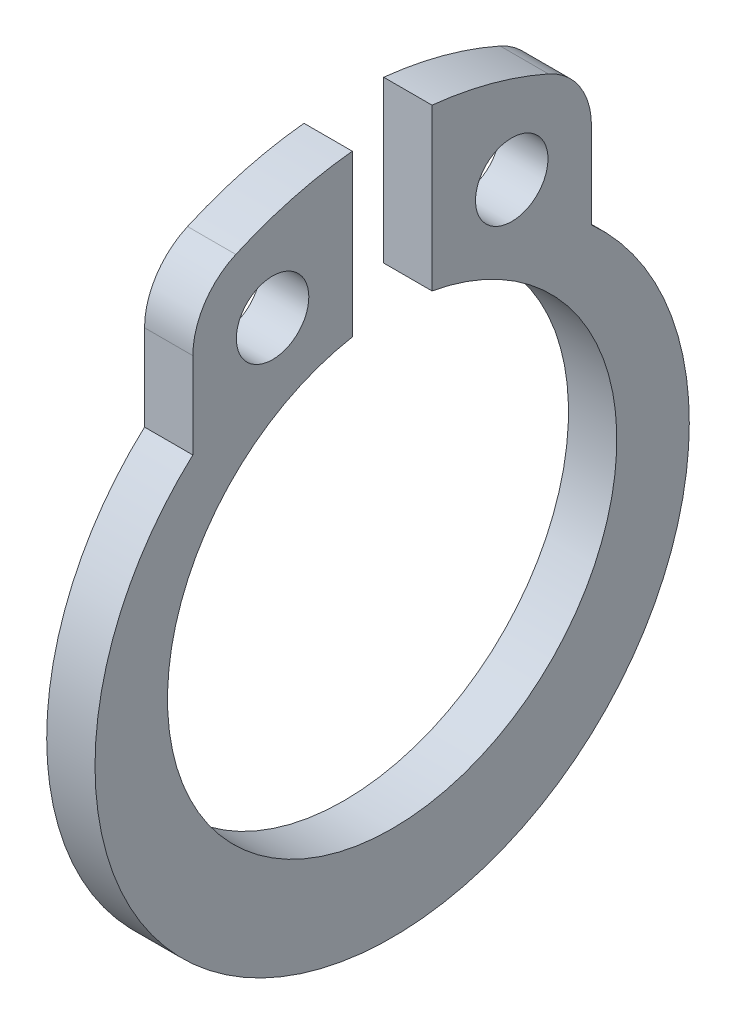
ISO-10303-21;
HEADER;
FILE_DESCRIPTION(('STEP AP214'),'2;1');
FILE_NAME('part.step','',(''),(''),'','','');
FILE_SCHEMA(('AUTOMOTIVE_DESIGN { 1 0 10303 214 1 1 1 1 }'));
ENDSEC;
DATA;
#1=APPLICATION_CONTEXT('core data for automotive mechanical design processes');
#2=APPLICATION_PROTOCOL_DEFINITION('international standard','automotive_design',2000,#1);
#3=PRODUCT_CONTEXT('',#1,'mechanical');
#4=PRODUCT('Part','Part','',(#3));
#5=PRODUCT_RELATED_PRODUCT_CATEGORY('part','',(#4));
#6=PRODUCT_DEFINITION_FORMATION('','',#4);
#7=PRODUCT_DEFINITION_CONTEXT('part definition',#1,'design');
#8=PRODUCT_DEFINITION('design','',#6,#7);
#9=PRODUCT_DEFINITION_SHAPE('','',#8);
#10=(LENGTH_UNIT() NAMED_UNIT(*) SI_UNIT(.MILLI.,.METRE.));
#11=(NAMED_UNIT(*) PLANE_ANGLE_UNIT() SI_UNIT($,.RADIAN.));
#12=(NAMED_UNIT(*) SI_UNIT($,.STERADIAN.) SOLID_ANGLE_UNIT());
#13=UNCERTAINTY_MEASURE_WITH_UNIT(LENGTH_MEASURE(1.E-05),#10,'distance_accuracy_value','');
#14=(GEOMETRIC_REPRESENTATION_CONTEXT(3) GLOBAL_UNCERTAINTY_ASSIGNED_CONTEXT((#13)) GLOBAL_UNIT_ASSIGNED_CONTEXT((#10,
#11,#12)) REPRESENTATION_CONTEXT('',''));
#15=CARTESIAN_POINT('',(0.,0.,0.));
#16=DIRECTION('',(0.,0.,1.));
#17=DIRECTION('',(1.,0.,0.));
#18=AXIS2_PLACEMENT_3D('',#15,#16,#17);
#19=CARTESIAN_POINT('',(1.,5.89167845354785,2.62500000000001));
#20=DIRECTION('',(-1.,0.,0.));
#21=DIRECTION('',(0.,0.,1.));
#22=AXIS2_PLACEMENT_3D('',#19,#20,#21);
#23=CYLINDRICAL_SURFACE('',#22,1.5);
#24=CARTESIAN_POINT('',(0.,5.89167845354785,2.62500000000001));
#25=DIRECTION('',(-1.,0.,0.));
#26=DIRECTION('',(0.,0.,1.));
#27=AXIS2_PLACEMENT_3D('',#24,#25,#26);
#28=CIRCLE('',#27,1.5);
#29=CARTESIAN_POINT('',(0.,5.89167845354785,4.12500000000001));
#30=VERTEX_POINT('',#29);
#31=CARTESIAN_POINT('',(0.,7.2618362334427,3.23546511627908));
#32=VERTEX_POINT('',#31);
#33=EDGE_CURVE('E144',#30,#32,#28,.T.);
#34=ORIENTED_EDGE('',*,*,#33,.F.);
#35=DIRECTION('',(-1.,0.,0.));
#36=VECTOR('',#35,1.);
#37=CARTESIAN_POINT('',(1.,5.89167845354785,4.12500000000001));
#38=LINE('',#37,#36);
#39=CARTESIAN_POINT('',(1.,5.89167845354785,4.12500000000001));
#40=VERTEX_POINT('',#39);
#41=EDGE_CURVE('E11',#40,#30,#38,.T.);
#42=ORIENTED_EDGE('',*,*,#41,.F.);
#43=CARTESIAN_POINT('',(1.,5.89167845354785,2.62500000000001));
#44=DIRECTION('',(-1.,0.,0.));
#45=DIRECTION('',(0.,0.,1.));
#46=AXIS2_PLACEMENT_3D('',#43,#44,#45);
#47=CIRCLE('',#46,1.5);
#48=CARTESIAN_POINT('',(1.,7.2618362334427,3.23546511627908));
#49=VERTEX_POINT('',#48);
#50=EDGE_CURVE('E171',#40,#49,#47,.T.);
#51=ORIENTED_EDGE('',*,*,#50,.T.);
#52=DIRECTION('',(-1.,0.,0.));
#53=VECTOR('',#52,1.);
#54=CARTESIAN_POINT('',(1.,7.2618362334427,3.23546511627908));
#55=LINE('',#54,#53);
#56=EDGE_CURVE('E38',#49,#32,#55,.T.);
#57=ORIENTED_EDGE('',*,*,#56,.T.);
#58=EDGE_LOOP('',(#34,#42,#51,#57));
#59=FACE_BOUND('',#58,.T.);
#60=ADVANCED_FACE('F35',(#59),#23,.T.);
#61=CARTESIAN_POINT('',(1.,4.11145535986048,4.12500000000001));
#62=DIRECTION('',(0.,0.,1.));
#63=DIRECTION('',(0.,-1.,0.));
#64=AXIS2_PLACEMENT_3D('',#61,#62,#63);
#65=PLANE('',#64);
#66=DIRECTION('',(0.,1.,0.));
#67=VECTOR('',#66,1.);
#68=CARTESIAN_POINT('',(0.,4.11145535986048,4.12500000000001));
#69=LINE('',#68,#67);
#70=CARTESIAN_POINT('',(0.,4.11145535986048,4.12500000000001));
#71=VERTEX_POINT('',#70);
#72=EDGE_CURVE('E169',#71,#30,#69,.T.);
#73=ORIENTED_EDGE('',*,*,#72,.F.);
#74=DIRECTION('',(-1.,0.,0.));
#75=VECTOR('',#74,1.);
#76=CARTESIAN_POINT('',(1.,4.11145535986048,4.12500000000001));
#77=LINE('',#76,#75);
#78=CARTESIAN_POINT('',(1.,4.11145535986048,4.12500000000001));
#79=VERTEX_POINT('',#78);
#80=EDGE_CURVE('E44',#79,#71,#77,.T.);
#81=ORIENTED_EDGE('',*,*,#80,.F.);
#82=DIRECTION('',(0.,1.,0.));
#83=VECTOR('',#82,1.);
#84=CARTESIAN_POINT('',(1.,4.11145535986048,4.12500000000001));
#85=LINE('',#84,#83);
#86=EDGE_CURVE('E134',#79,#40,#85,.T.);
#87=ORIENTED_EDGE('',*,*,#86,.T.);
#88=ORIENTED_EDGE('',*,*,#41,.T.);
#89=EDGE_LOOP('',(#73,#81,#87,#88));
#90=FACE_BOUND('',#89,.T.);
#91=ADVANCED_FACE('F187',(#90),#65,.T.);
#92=CARTESIAN_POINT('',(1.,-0.450000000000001,0.));
#93=DIRECTION('',(-1.,0.,0.));
#94=DIRECTION('',(0.,0.,1.));
#95=AXIS2_PLACEMENT_3D('',#92,#93,#94);
#96=CYLINDRICAL_SURFACE('',#95,6.15);
#97=CARTESIAN_POINT('',(0.,-0.450000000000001,0.));
#98=DIRECTION('',(-1.,0.,0.));
#99=DIRECTION('',(0.,0.,1.));
#100=AXIS2_PLACEMENT_3D('',#97,#98,#99);
#101=CIRCLE('',#100,6.15);
#102=CARTESIAN_POINT('',(0.,4.11145535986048,-4.12500000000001));
#103=VERTEX_POINT('',#102);
#104=EDGE_CURVE('E121',#103,#71,#101,.T.);
#105=ORIENTED_EDGE('',*,*,#104,.F.);
#106=DIRECTION('',(-1.,0.,0.));
#107=VECTOR('',#106,1.);
#108=CARTESIAN_POINT('',(1.,4.11145535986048,-4.12500000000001));
#109=LINE('',#108,#107);
#110=CARTESIAN_POINT('',(1.,4.11145535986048,-4.12500000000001));
#111=VERTEX_POINT('',#110);
#112=EDGE_CURVE('E116',#111,#103,#109,.T.);
#113=ORIENTED_EDGE('',*,*,#112,.F.);
#114=CARTESIAN_POINT('',(1.,-0.450000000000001,0.));
#115=DIRECTION('',(-1.,0.,0.));
#116=DIRECTION('',(0.,0.,1.));
#117=AXIS2_PLACEMENT_3D('',#114,#115,#116);
#118=CIRCLE('',#117,6.15);
#119=EDGE_CURVE('E119',#111,#79,#118,.T.);
#120=ORIENTED_EDGE('',*,*,#119,.T.);
#121=ORIENTED_EDGE('',*,*,#80,.T.);
#122=EDGE_LOOP('',(#105,#113,#120,#121));
#123=FACE_BOUND('',#122,.T.);
#124=ADVANCED_FACE('F118',(#123),#96,.T.);
#125=CARTESIAN_POINT('',(1.,5.89167845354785,-4.12500000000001));
#126=DIRECTION('',(0.,0.,-1.));
#127=DIRECTION('',(0.,1.,0.));
#128=AXIS2_PLACEMENT_3D('',#125,#126,#127);
#129=PLANE('',#128);
#130=DIRECTION('',(0.,-1.,0.));
#131=VECTOR('',#130,1.);
#132=CARTESIAN_POINT('',(0.,5.89167845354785,-4.12500000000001));
#133=LINE('',#132,#131);
#134=CARTESIAN_POINT('',(0.,5.89167845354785,-4.12500000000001));
#135=VERTEX_POINT('',#134);
#136=EDGE_CURVE('E166',#135,#103,#133,.T.);
#137=ORIENTED_EDGE('',*,*,#136,.F.);
#138=DIRECTION('',(-1.,0.,0.));
#139=VECTOR('',#138,1.);
#140=CARTESIAN_POINT('',(1.,5.89167845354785,-4.12500000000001));
#141=LINE('',#140,#139);
#142=CARTESIAN_POINT('',(1.,5.89167845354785,-4.12500000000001));
#143=VERTEX_POINT('',#142);
#144=EDGE_CURVE('E126',#143,#135,#141,.T.);
#145=ORIENTED_EDGE('',*,*,#144,.F.);
#146=DIRECTION('',(0.,-1.,0.));
#147=VECTOR('',#146,1.);
#148=CARTESIAN_POINT('',(1.,5.89167845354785,-4.12500000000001));
#149=LINE('',#148,#147);
#150=EDGE_CURVE('E132',#143,#111,#149,.T.);
#151=ORIENTED_EDGE('',*,*,#150,.T.);
#152=ORIENTED_EDGE('',*,*,#112,.T.);
#153=EDGE_LOOP('',(#137,#145,#151,#152));
#154=FACE_BOUND('',#153,.T.);
#155=ADVANCED_FACE('F136',(#154),#129,.T.);
#156=CARTESIAN_POINT('',(1.,5.89167845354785,-2.62500000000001));
#157=DIRECTION('',(-1.,0.,0.));
#158=DIRECTION('',(0.,0.,1.));
#159=AXIS2_PLACEMENT_3D('',#156,#157,#158);
#160=CYLINDRICAL_SURFACE('',#159,1.5);
#161=CARTESIAN_POINT('',(0.,5.89167845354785,-2.62500000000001));
#162=DIRECTION('',(-1.,0.,0.));
#163=DIRECTION('',(0.,0.,1.));
#164=AXIS2_PLACEMENT_3D('',#161,#162,#163);
#165=CIRCLE('',#164,1.5);
#166=CARTESIAN_POINT('',(0.,7.2618362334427,-3.23546511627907));
#167=VERTEX_POINT('',#166);
#168=EDGE_CURVE('E163',#167,#135,#165,.T.);
#169=ORIENTED_EDGE('',*,*,#168,.F.);
#170=DIRECTION('',(-1.,0.,0.));
#171=VECTOR('',#170,1.);
#172=CARTESIAN_POINT('',(1.,7.2618362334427,-3.23546511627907));
#173=LINE('',#172,#171);
#174=CARTESIAN_POINT('',(1.,7.2618362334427,-3.23546511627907));
#175=VERTEX_POINT('',#174);
#176=EDGE_CURVE('E175',#175,#167,#173,.T.);
#177=ORIENTED_EDGE('',*,*,#176,.F.);
#178=CARTESIAN_POINT('',(1.,5.89167845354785,-2.62500000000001));
#179=DIRECTION('',(-1.,0.,0.));
#180=DIRECTION('',(0.,0.,1.));
#181=AXIS2_PLACEMENT_3D('',#178,#179,#180);
#182=CIRCLE('',#181,1.5);
#183=EDGE_CURVE('E137',#175,#143,#182,.T.);
#184=ORIENTED_EDGE('',*,*,#183,.T.);
#185=ORIENTED_EDGE('',*,*,#144,.T.);
#186=EDGE_LOOP('',(#169,#177,#184,#185));
#187=FACE_BOUND('',#186,.T.);
#188=ADVANCED_FACE('F200',(#187),#160,.T.);
#189=CARTESIAN_POINT('',(1.,0.,0.));
#190=DIRECTION('',(-1.,0.,0.));
#191=DIRECTION('',(0.,0.,1.));
#192=AXIS2_PLACEMENT_3D('',#189,#190,#191);
#193=CYLINDRICAL_SURFACE('',#192,7.95000000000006);
#194=CARTESIAN_POINT('',(0.,0.,0.));
#195=DIRECTION('',(-1.,0.,0.));
#196=DIRECTION('',(0.,0.,1.));
#197=AXIS2_PLACEMENT_3D('',#194,#195,#196);
#198=CIRCLE('',#197,7.95000000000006);
#199=CARTESIAN_POINT('',(0.,7.90707752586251,-0.824999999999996));
#200=VERTEX_POINT('',#199);
#201=EDGE_CURVE('E160',#200,#167,#198,.T.);
#202=ORIENTED_EDGE('',*,*,#201,.F.);
#203=DIRECTION('',(-1.,0.,0.));
#204=VECTOR('',#203,1.);
#205=CARTESIAN_POINT('',(1.,7.90707752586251,-0.824999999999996));
#206=LINE('',#205,#204);
#207=CARTESIAN_POINT('',(1.,7.90707752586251,-0.824999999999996));
#208=VERTEX_POINT('',#207);
#209=EDGE_CURVE('E177',#208,#200,#206,.T.);
#210=ORIENTED_EDGE('',*,*,#209,.F.);
#211=CARTESIAN_POINT('',(1.,0.,0.));
#212=DIRECTION('',(-1.,0.,0.));
#213=DIRECTION('',(0.,0.,1.));
#214=AXIS2_PLACEMENT_3D('',#211,#212,#213);
#215=CIRCLE('',#214,7.95000000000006);
#216=EDGE_CURVE('E139',#208,#175,#215,.T.);
#217=ORIENTED_EDGE('',*,*,#216,.T.);
#218=ORIENTED_EDGE('',*,*,#176,.T.);
#219=EDGE_LOOP('',(#202,#210,#217,#218));
#220=FACE_BOUND('',#219,.T.);
#221=ADVANCED_FACE('F203',(#220),#193,.T.);
#222=CARTESIAN_POINT('',(1.,4.57622934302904,-0.824999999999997));
#223=DIRECTION('',(0.,0.,1.));
#224=DIRECTION('',(1.,0.,0.));
#225=AXIS2_PLACEMENT_3D('',#222,#223,#224);
#226=PLANE('',#225);
#227=DIRECTION('',(0.,1.,0.));
#228=VECTOR('',#227,1.);
#229=CARTESIAN_POINT('',(0.,4.57622934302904,-0.824999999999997));
#230=LINE('',#229,#228);
#231=CARTESIAN_POINT('',(0.,4.57622934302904,-0.824999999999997));
#232=VERTEX_POINT('',#231);
#233=EDGE_CURVE('E157',#232,#200,#230,.T.);
#234=ORIENTED_EDGE('',*,*,#233,.F.);
#235=DIRECTION('',(-1.,0.,0.));
#236=VECTOR('',#235,1.);
#237=CARTESIAN_POINT('',(1.,4.57622934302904,-0.824999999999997));
#238=LINE('',#237,#236);
#239=CARTESIAN_POINT('',(1.,4.57622934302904,-0.824999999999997));
#240=VERTEX_POINT('',#239);
#241=EDGE_CURVE('E179',#240,#232,#238,.T.);
#242=ORIENTED_EDGE('',*,*,#241,.F.);
#243=DIRECTION('',(0.,1.,0.));
#244=VECTOR('',#243,1.);
#245=CARTESIAN_POINT('',(1.,4.57622934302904,-0.824999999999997));
#246=LINE('',#245,#244);
#247=EDGE_CURVE('E263',#240,#208,#246,.T.);
#248=ORIENTED_EDGE('',*,*,#247,.T.);
#249=ORIENTED_EDGE('',*,*,#209,.T.);
#250=EDGE_LOOP('',(#234,#242,#248,#249));
#251=FACE_BOUND('',#250,.T.);
#252=ADVANCED_FACE('F207',(#251),#226,.T.);
#253=CARTESIAN_POINT('',(1.,0.,0.));
#254=DIRECTION('',(-1.,0.,0.));
#255=DIRECTION('',(0.,0.,1.));
#256=AXIS2_PLACEMENT_3D('',#253,#254,#255);
#257=CYLINDRICAL_SURFACE('',#256,4.65000000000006);
#258=CARTESIAN_POINT('',(0.,0.,0.));
#259=DIRECTION('',(1.,0.,0.));
#260=DIRECTION('',(0.,0.,-1.));
#261=AXIS2_PLACEMENT_3D('',#258,#259,#260);
#262=CIRCLE('',#261,4.65000000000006);
#263=CARTESIAN_POINT('',(0.,4.57622934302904,0.824999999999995));
#264=VERTEX_POINT('',#263);
#265=EDGE_CURVE('E154',#264,#232,#262,.T.);
#266=ORIENTED_EDGE('',*,*,#265,.F.);
#267=DIRECTION('',(-1.,0.,0.));
#268=VECTOR('',#267,1.);
#269=CARTESIAN_POINT('',(1.,4.57622934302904,0.824999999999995));
#270=LINE('',#269,#268);
#271=CARTESIAN_POINT('',(1.,4.57622934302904,0.824999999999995));
#272=VERTEX_POINT('',#271);
#273=EDGE_CURVE('E181',#272,#264,#270,.T.);
#274=ORIENTED_EDGE('',*,*,#273,.F.);
#275=CARTESIAN_POINT('',(1.,0.,0.));
#276=DIRECTION('',(1.,0.,0.));
#277=DIRECTION('',(0.,0.,-1.));
#278=AXIS2_PLACEMENT_3D('',#275,#276,#277);
#279=CIRCLE('',#278,4.65000000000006);
#280=EDGE_CURVE('E260',#272,#240,#279,.T.);
#281=ORIENTED_EDGE('',*,*,#280,.T.);
#282=ORIENTED_EDGE('',*,*,#241,.T.);
#283=EDGE_LOOP('',(#266,#274,#281,#282));
#284=FACE_BOUND('',#283,.T.);
#285=ADVANCED_FACE('F211',(#284),#257,.F.);
#286=CARTESIAN_POINT('',(1.,7.90707752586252,0.824999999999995));
#287=DIRECTION('',(0.,0.,-1.));
#288=DIRECTION('',(-1.,0.,0.));
#289=AXIS2_PLACEMENT_3D('',#286,#287,#288);
#290=PLANE('',#289);
#291=DIRECTION('',(0.,-1.,0.));
#292=VECTOR('',#291,1.);
#293=CARTESIAN_POINT('',(0.,7.90707752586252,0.824999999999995));
#294=LINE('',#293,#292);
#295=CARTESIAN_POINT('',(0.,7.90707752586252,0.824999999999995));
#296=VERTEX_POINT('',#295);
#297=EDGE_CURVE('E151',#296,#264,#294,.T.);
#298=ORIENTED_EDGE('',*,*,#297,.F.);
#299=DIRECTION('',(-1.,0.,0.));
#300=VECTOR('',#299,1.);
#301=CARTESIAN_POINT('',(1.,7.90707752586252,0.824999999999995));
#302=LINE('',#301,#300);
#303=CARTESIAN_POINT('',(1.,7.90707752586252,0.824999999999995));
#304=VERTEX_POINT('',#303);
#305=EDGE_CURVE('E182',#304,#296,#302,.T.);
#306=ORIENTED_EDGE('',*,*,#305,.F.);
#307=DIRECTION('',(0.,-1.,0.));
#308=VECTOR('',#307,1.);
#309=CARTESIAN_POINT('',(1.,7.90707752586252,0.824999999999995));
#310=LINE('',#309,#308);
#311=EDGE_CURVE('E257',#304,#272,#310,.T.);
#312=ORIENTED_EDGE('',*,*,#311,.T.);
#313=ORIENTED_EDGE('',*,*,#273,.T.);
#314=EDGE_LOOP('',(#298,#306,#312,#313));
#315=FACE_BOUND('',#314,.T.);
#316=ADVANCED_FACE('F215',(#315),#290,.T.);
#317=CARTESIAN_POINT('',(1.,0.,0.));
#318=DIRECTION('',(-1.,0.,0.));
#319=DIRECTION('',(0.,0.,1.));
#320=AXIS2_PLACEMENT_3D('',#317,#318,#319);
#321=CYLINDRICAL_SURFACE('',#320,7.95000000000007);
#322=CARTESIAN_POINT('',(0.,0.,0.));
#323=DIRECTION('',(-1.,0.,0.));
#324=DIRECTION('',(0.,0.,1.));
#325=AXIS2_PLACEMENT_3D('',#322,#323,#324);
#326=CIRCLE('',#325,7.95000000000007);
#327=EDGE_CURVE('E147',#32,#296,#326,.T.);
#328=ORIENTED_EDGE('',*,*,#327,.F.);
#329=ORIENTED_EDGE('',*,*,#56,.F.);
#330=CARTESIAN_POINT('',(1.,0.,0.));
#331=DIRECTION('',(-1.,0.,0.));
#332=DIRECTION('',(0.,0.,1.));
#333=AXIS2_PLACEMENT_3D('',#330,#331,#332);
#334=CIRCLE('',#333,7.95000000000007);
#335=EDGE_CURVE('E255',#49,#304,#334,.T.);
#336=ORIENTED_EDGE('',*,*,#335,.T.);
#337=ORIENTED_EDGE('',*,*,#305,.T.);
#338=EDGE_LOOP('',(#328,#329,#336,#337));
#339=FACE_BOUND('',#338,.T.);
#340=ADVANCED_FACE('F184',(#339),#321,.T.);
#341=CARTESIAN_POINT('',(1.,5.89167845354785,2.62500000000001));
#342=DIRECTION('',(-1.,0.,0.));
#343=DIRECTION('',(0.,0.,1.));
#344=AXIS2_PLACEMENT_3D('',#341,#342,#343);
#345=PLANE('',#344);
#346=CARTESIAN_POINT('',(1.,5.74576546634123,2.47500000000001));
#347=DIRECTION('',(-1.,0.,0.));
#348=DIRECTION('',(0.,0.,-1.));
#349=AXIS2_PLACEMENT_3D('',#346,#347,#348);
#350=CIRCLE('',#349,0.75);
#351=CARTESIAN_POINT('',(1.,5.74576546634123,1.72500000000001));
#352=VERTEX_POINT('',#351);
#353=EDGE_CURVE('E242',#352,#352,#350,.T.);
#354=ORIENTED_EDGE('',*,*,#353,.T.);
#355=EDGE_LOOP('',(#354));
#356=FACE_BOUND('',#355,.T.);
#357=CARTESIAN_POINT('',(1.,5.74576546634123,-2.47500000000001));
#358=DIRECTION('',(-1.,0.,0.));
#359=DIRECTION('',(0.,0.,-1.));
#360=AXIS2_PLACEMENT_3D('',#357,#358,#359);
#361=CIRCLE('',#360,0.75);
#362=CARTESIAN_POINT('',(1.,5.74576546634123,-3.22500000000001));
#363=VERTEX_POINT('',#362);
#364=EDGE_CURVE('E148',#363,#363,#361,.T.);
#365=ORIENTED_EDGE('',*,*,#364,.T.);
#366=EDGE_LOOP('',(#365));
#367=FACE_BOUND('',#366,.T.);
#368=ORIENTED_EDGE('',*,*,#50,.F.);
#369=ORIENTED_EDGE('',*,*,#86,.F.);
#370=ORIENTED_EDGE('',*,*,#119,.F.);
#371=ORIENTED_EDGE('',*,*,#150,.F.);
#372=ORIENTED_EDGE('',*,*,#183,.F.);
#373=ORIENTED_EDGE('',*,*,#216,.F.);
#374=ORIENTED_EDGE('',*,*,#247,.F.);
#375=ORIENTED_EDGE('',*,*,#280,.F.);
#376=ORIENTED_EDGE('',*,*,#311,.F.);
#377=ORIENTED_EDGE('',*,*,#335,.F.);
#378=EDGE_LOOP('',(#368,#369,#370,#371,#372,#373,#374,#375,#376,#377));
#379=FACE_BOUND('',#378,.T.);
#380=ADVANCED_FACE('F130',(#356,#367,#379),#345,.F.);
#381=CARTESIAN_POINT('',(0.,5.89167845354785,2.62500000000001));
#382=DIRECTION('',(-1.,0.,0.));
#383=DIRECTION('',(0.,0.,1.));
#384=AXIS2_PLACEMENT_3D('',#381,#382,#383);
#385=PLANE('',#384);
#386=CARTESIAN_POINT('',(0.,5.74576546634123,2.47500000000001));
#387=DIRECTION('',(-1.,0.,0.));
#388=DIRECTION('',(0.,0.,-1.));
#389=AXIS2_PLACEMENT_3D('',#386,#387,#388);
#390=CIRCLE('',#389,0.75);
#391=CARTESIAN_POINT('',(0.,5.74576546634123,1.72500000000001));
#392=VERTEX_POINT('',#391);
#393=EDGE_CURVE('E245',#392,#392,#390,.T.);
#394=ORIENTED_EDGE('',*,*,#393,.F.);
#395=EDGE_LOOP('',(#394));
#396=FACE_BOUND('',#395,.T.);
#397=CARTESIAN_POINT('',(0.,5.74576546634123,-2.47500000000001));
#398=DIRECTION('',(-1.,0.,0.));
#399=DIRECTION('',(0.,0.,-1.));
#400=AXIS2_PLACEMENT_3D('',#397,#398,#399);
#401=CIRCLE('',#400,0.75);
#402=CARTESIAN_POINT('',(0.,5.74576546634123,-3.22500000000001));
#403=VERTEX_POINT('',#402);
#404=EDGE_CURVE('E247',#403,#403,#401,.T.);
#405=ORIENTED_EDGE('',*,*,#404,.F.);
#406=EDGE_LOOP('',(#405));
#407=FACE_BOUND('',#406,.T.);
#408=ORIENTED_EDGE('',*,*,#33,.T.);
#409=ORIENTED_EDGE('',*,*,#327,.T.);
#410=ORIENTED_EDGE('',*,*,#297,.T.);
#411=ORIENTED_EDGE('',*,*,#265,.T.);
#412=ORIENTED_EDGE('',*,*,#233,.T.);
#413=ORIENTED_EDGE('',*,*,#201,.T.);
#414=ORIENTED_EDGE('',*,*,#168,.T.);
#415=ORIENTED_EDGE('',*,*,#136,.T.);
#416=ORIENTED_EDGE('',*,*,#104,.T.);
#417=ORIENTED_EDGE('',*,*,#72,.T.);
#418=EDGE_LOOP('',(#408,#409,#410,#411,#412,#413,#414,#415,#416,#417));
#419=FACE_BOUND('',#418,.T.);
#420=ADVANCED_FACE('F186',(#396,#407,#419),#385,.T.);
#421=CARTESIAN_POINT('',(1.,5.74576546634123,-2.47500000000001));
#422=DIRECTION('',(-1.,0.,0.));
#423=DIRECTION('',(0.,0.,1.));
#424=AXIS2_PLACEMENT_3D('',#421,#422,#423);
#425=CYLINDRICAL_SURFACE('',#424,0.75);
#426=ORIENTED_EDGE('',*,*,#364,.F.);
#427=EDGE_LOOP('',(#426));
#428=FACE_BOUND('',#427,.T.);
#429=ORIENTED_EDGE('',*,*,#404,.T.);
#430=EDGE_LOOP('',(#429));
#431=FACE_BOUND('',#430,.T.);
#432=ADVANCED_FACE('F227',(#428,#431),#425,.F.);
#433=CARTESIAN_POINT('',(1.,5.74576546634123,2.47500000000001));
#434=DIRECTION('',(-1.,0.,0.));
#435=DIRECTION('',(0.,0.,1.));
#436=AXIS2_PLACEMENT_3D('',#433,#434,#435);
#437=CYLINDRICAL_SURFACE('',#436,0.75);
#438=ORIENTED_EDGE('',*,*,#353,.F.);
#439=EDGE_LOOP('',(#438));
#440=FACE_BOUND('',#439,.T.);
#441=ORIENTED_EDGE('',*,*,#393,.T.);
#442=EDGE_LOOP('',(#441));
#443=FACE_BOUND('',#442,.T.);
#444=ADVANCED_FACE('F234',(#440,#443),#437,.F.);
#445=CLOSED_SHELL('',(#60,#91,#124,#155,#188,#221,#252,#285,#316,#340,#380,#420,#432,#444));
#446=MANIFOLD_SOLID_BREP('B2',#445);
#447=ADVANCED_BREP_SHAPE_REPRESENTATION('',(#18,#446),#14);
#448=SHAPE_DEFINITION_REPRESENTATION(#9,#447);
ENDSEC;
END-ISO-10303-21;
